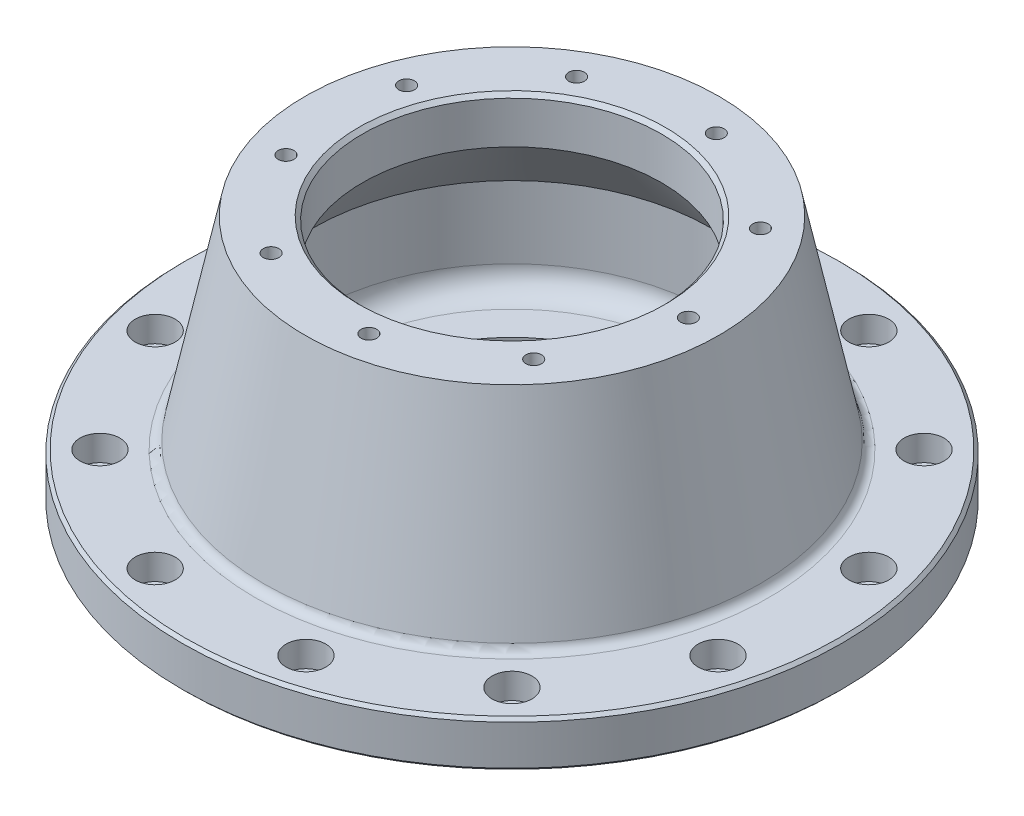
from build123d import *

# Parameters (mm, degrees)
FILLET1_R                                            = 6
CBORE_FOR_M16_HEX_SOCKET_HEAD_CAP_SCREW1_D           = 17.5
CBORE_FOR_M16_HEX_SOCKET_HEAD_CAP_SCREW1_CBORE_D     = 26
CBORE_FOR_M16_HEX_SOCKET_HEAD_CAP_SCREW1_CBORE_DEPTH = 16.6
CIRPATTERN2_COUNT                                    = 12
CHAMFER1_SIZE                                        = 1.8
CHAMFER2_SIZE                                        = 2.5
FILLET2_R                                            = 15
CHAMFER3_SIZE                                        = 2
CIRPATTERN3_COUNT                                    = 9


with BuildPart() as part:
    # Sketch1 → Revolve1 (revolve)
    with BuildSketch(Plane.XY, mode=Mode.PRIVATE) as revolve1_sk:
        Polygon((80, 0), (215, 0), (215, 30), (162.5, 30), (135, 162), (97.5, 162), (97.5, 132), (130, 90), (130, 28), (92.5, 28), (92.5, 15), (80, 15), align=None)
    revolve(revolve1_sk.sketch.rotate(Axis((0, 0, 0), (0, 1, 0)), 90), axis=Axis((0, 0, 0), (0, 1, 0)))

    # Fillet1
    fillet1_edges = [part.edges().sort_by_distance(p)[0] for p in [
        (0, 30, 162.5),
    ]]
    fillet(fillet1_edges, radius=FILLET1_R)

    # CBORE for M16 Hex Socket Head Cap Screw1 (through all)
    with Locations(Plane(origin=(0, 30, 0), x_dir=(1, 0, 0), z_dir=(0, 1, 0))):
        with Locations((49.175618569, 183.525906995)):
            cbore_for_m16_hex_socket_head_cap_screw1 = CounterBoreHole(CBORE_FOR_M16_HEX_SOCKET_HEAD_CAP_SCREW1_D / 2, CBORE_FOR_M16_HEX_SOCKET_HEAD_CAP_SCREW1_CBORE_D / 2, CBORE_FOR_M16_HEX_SOCKET_HEAD_CAP_SCREW1_CBORE_DEPTH)

    # CirPattern2: CBORE for M16 Hex Socket Head Cap Screw1 ×12 about axis
    cirpattern2_axis = Axis((0, 0, 0), (0, 1, 0))
    for i in range(1, CIRPATTERN2_COUNT):
        add(cbore_for_m16_hex_socket_head_cap_screw1.rotate(cirpattern2_axis, i * 360 / CIRPATTERN2_COUNT), mode=Mode.SUBTRACT)

    # Chamfer1
    chamfer1_edges = [part.edges().sort_by_distance(p)[0] for p in [
        (0, 0, 80),
        (0, 15, 80),
    ]]
    chamfer(chamfer1_edges, length=CHAMFER1_SIZE)

    # Chamfer2
    chamfer2_edges = [part.edges().sort_by_distance(p)[0] for p in [
        (0, 162, 97.5),
    ]]
    chamfer(chamfer2_edges, length=CHAMFER2_SIZE)

    # Sketch9 → M12 Tapped Hole1 (revolve, cut)
    with BuildSketch(Plane(origin=(115, 162, 0), x_dir=(0, 0, 1), z_dir=(1, 0, 0))):
        Polygon((0, 0), (0, 35.064389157), (5.1, 32), (5.1, 0), align=None)
    m12_tapped_hole1 = revolve(axis=Axis((115, 168.35, 0), (0, -1, 0)), mode=Mode.SUBTRACT)

    # Fillet2
    fillet2_edges = [part.edges().sort_by_distance(p)[0] for p in [
        (0, 28, 130),
    ]]
    fillet(fillet2_edges, radius=FILLET2_R)

    # Chamfer3
    chamfer3_edges = [part.edges().sort_by_distance(p)[0] for p in [
        (0, 30, 215),
        (0, 0, 215),
    ]]
    chamfer(chamfer3_edges, length=CHAMFER3_SIZE)

    # CirPattern3: M12 Tapped Hole1 ×9 about axis
    cirpattern3_axis = Axis((0, 0, 0), (0, 1, 0))
    for i in range(1, CIRPATTERN3_COUNT):
        add(m12_tapped_hole1.rotate(cirpattern3_axis, i * 360 / CIRPATTERN3_COUNT), mode=Mode.SUBTRACT)


solid = part.part
